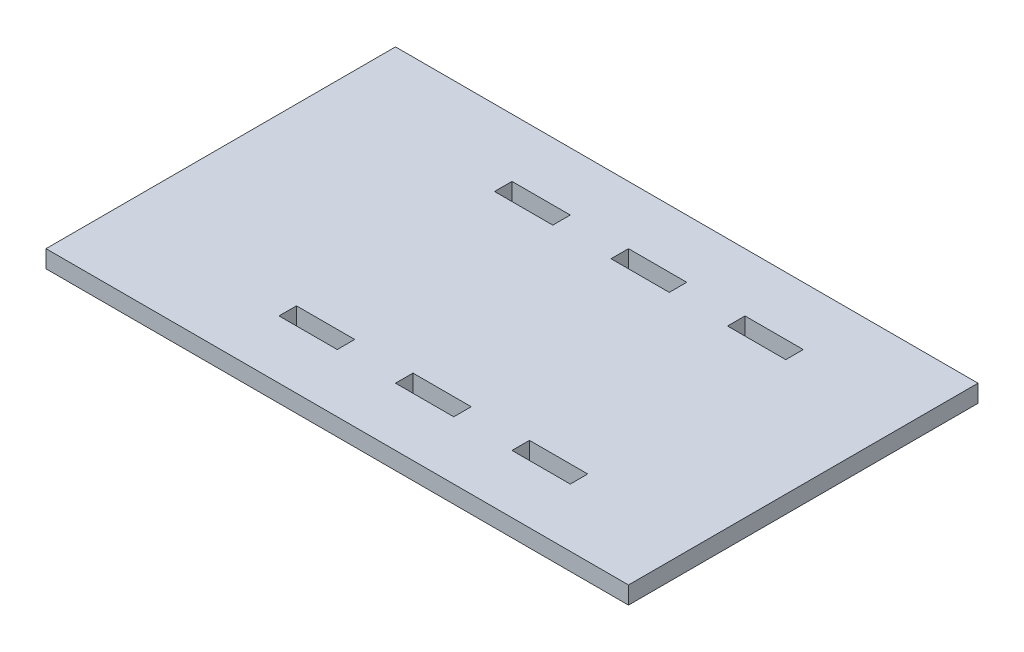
ISO-10303-21;
HEADER;
FILE_DESCRIPTION(('STEP AP214'),'2;1');
FILE_NAME('part.step','',(''),(''),'','','');
FILE_SCHEMA(('AUTOMOTIVE_DESIGN { 1 0 10303 214 1 1 1 1 }'));
ENDSEC;
DATA;
#1=APPLICATION_CONTEXT('core data for automotive mechanical design processes');
#2=APPLICATION_PROTOCOL_DEFINITION('international standard','automotive_design',2000,#1);
#3=PRODUCT_CONTEXT('',#1,'mechanical');
#4=PRODUCT('Part','Part','',(#3));
#5=PRODUCT_RELATED_PRODUCT_CATEGORY('part','',(#4));
#6=PRODUCT_DEFINITION_FORMATION('','',#4);
#7=PRODUCT_DEFINITION_CONTEXT('part definition',#1,'design');
#8=PRODUCT_DEFINITION('design','',#6,#7);
#9=PRODUCT_DEFINITION_SHAPE('','',#8);
#10=(LENGTH_UNIT() NAMED_UNIT(*) SI_UNIT(.MILLI.,.METRE.));
#11=(NAMED_UNIT(*) PLANE_ANGLE_UNIT() SI_UNIT($,.RADIAN.));
#12=(NAMED_UNIT(*) SI_UNIT($,.STERADIAN.) SOLID_ANGLE_UNIT());
#13=UNCERTAINTY_MEASURE_WITH_UNIT(LENGTH_MEASURE(1.E-05),#10,'distance_accuracy_value','');
#14=(GEOMETRIC_REPRESENTATION_CONTEXT(3) GLOBAL_UNCERTAINTY_ASSIGNED_CONTEXT((#13)) GLOBAL_UNIT_ASSIGNED_CONTEXT((#10,
#11,#12)) REPRESENTATION_CONTEXT('',''));
#15=CARTESIAN_POINT('',(0.,0.,0.));
#16=DIRECTION('',(0.,0.,1.));
#17=DIRECTION('',(1.,0.,0.));
#18=AXIS2_PLACEMENT_3D('',#15,#16,#17);
#19=CARTESIAN_POINT('',(250.,15.,150.));
#20=DIRECTION('',(-1.,0.,0.));
#21=DIRECTION('',(0.,0.,1.));
#22=AXIS2_PLACEMENT_3D('',#19,#20,#21);
#23=PLANE('',#22);
#24=DIRECTION('',(0.,0.,-1.));
#25=VECTOR('',#24,1.);
#26=CARTESIAN_POINT('',(250.,0.,150.));
#27=LINE('',#26,#25);
#28=CARTESIAN_POINT('',(250.,0.,150.));
#29=VERTEX_POINT('',#28);
#30=CARTESIAN_POINT('',(250.,0.,-150.));
#31=VERTEX_POINT('',#30);
#32=EDGE_CURVE('E484',#29,#31,#27,.T.);
#33=ORIENTED_EDGE('',*,*,#32,.T.);
#34=DIRECTION('',(0.,-1.,0.));
#35=VECTOR('',#34,1.);
#36=CARTESIAN_POINT('',(250.,15.,-150.));
#37=LINE('',#36,#35);
#38=CARTESIAN_POINT('',(250.,15.,-150.));
#39=VERTEX_POINT('',#38);
#40=EDGE_CURVE('E11',#39,#31,#37,.T.);
#41=ORIENTED_EDGE('',*,*,#40,.F.);
#42=DIRECTION('',(0.,0.,-1.));
#43=VECTOR('',#42,1.);
#44=CARTESIAN_POINT('',(250.,15.,150.));
#45=LINE('',#44,#43);
#46=CARTESIAN_POINT('',(250.,15.,150.));
#47=VERTEX_POINT('',#46);
#48=EDGE_CURVE('E494',#47,#39,#45,.T.);
#49=ORIENTED_EDGE('',*,*,#48,.F.);
#50=DIRECTION('',(0.,-1.,0.));
#51=VECTOR('',#50,1.);
#52=CARTESIAN_POINT('',(250.,15.,150.));
#53=LINE('',#52,#51);
#54=EDGE_CURVE('E508',#47,#29,#53,.T.);
#55=ORIENTED_EDGE('',*,*,#54,.T.);
#56=EDGE_LOOP('',(#33,#41,#49,#55));
#57=FACE_BOUND('',#56,.T.);
#58=ADVANCED_FACE('F45',(#57),#23,.F.);
#59=CARTESIAN_POINT('',(-250.,15.,-150.));
#60=DIRECTION('',(0.,0.,1.));
#61=DIRECTION('',(1.,0.,0.));
#62=AXIS2_PLACEMENT_3D('',#59,#60,#61);
#63=PLANE('',#62);
#64=DIRECTION('',(-1.,0.,0.));
#65=VECTOR('',#64,1.);
#66=CARTESIAN_POINT('',(-250.,0.,-150.));
#67=LINE('',#66,#65);
#68=CARTESIAN_POINT('',(-250.,0.,-150.));
#69=VERTEX_POINT('',#68);
#70=EDGE_CURVE('E512',#31,#69,#67,.T.);
#71=ORIENTED_EDGE('',*,*,#70,.T.);
#72=DIRECTION('',(0.,-1.,0.));
#73=VECTOR('',#72,1.);
#74=CARTESIAN_POINT('',(-250.,15.,-150.));
#75=LINE('',#74,#73);
#76=CARTESIAN_POINT('',(-250.,15.,-150.));
#77=VERTEX_POINT('',#76);
#78=EDGE_CURVE('E53',#77,#69,#75,.T.);
#79=ORIENTED_EDGE('',*,*,#78,.F.);
#80=DIRECTION('',(-1.,0.,0.));
#81=VECTOR('',#80,1.);
#82=CARTESIAN_POINT('',(-250.,15.,-150.));
#83=LINE('',#82,#81);
#84=EDGE_CURVE('E498',#39,#77,#83,.T.);
#85=ORIENTED_EDGE('',*,*,#84,.F.);
#86=ORIENTED_EDGE('',*,*,#40,.T.);
#87=EDGE_LOOP('',(#71,#79,#85,#86));
#88=FACE_BOUND('',#87,.T.);
#89=ADVANCED_FACE('F547',(#88),#63,.F.);
#90=CARTESIAN_POINT('',(-250.,15.,150.));
#91=DIRECTION('',(1.,0.,0.));
#92=DIRECTION('',(0.,0.,-1.));
#93=AXIS2_PLACEMENT_3D('',#90,#91,#92);
#94=PLANE('',#93);
#95=DIRECTION('',(0.,0.,1.));
#96=VECTOR('',#95,1.);
#97=CARTESIAN_POINT('',(-250.,0.,150.));
#98=LINE('',#97,#96);
#99=CARTESIAN_POINT('',(-250.,0.,150.));
#100=VERTEX_POINT('',#99);
#101=EDGE_CURVE('E515',#69,#100,#98,.T.);
#102=ORIENTED_EDGE('',*,*,#101,.T.);
#103=DIRECTION('',(0.,-1.,0.));
#104=VECTOR('',#103,1.);
#105=CARTESIAN_POINT('',(-250.,15.,150.));
#106=LINE('',#105,#104);
#107=CARTESIAN_POINT('',(-250.,15.,150.));
#108=VERTEX_POINT('',#107);
#109=EDGE_CURVE('E523',#108,#100,#106,.T.);
#110=ORIENTED_EDGE('',*,*,#109,.F.);
#111=DIRECTION('',(0.,0.,1.));
#112=VECTOR('',#111,1.);
#113=CARTESIAN_POINT('',(-250.,15.,150.));
#114=LINE('',#113,#112);
#115=EDGE_CURVE('E502',#77,#108,#114,.T.);
#116=ORIENTED_EDGE('',*,*,#115,.F.);
#117=ORIENTED_EDGE('',*,*,#78,.T.);
#118=EDGE_LOOP('',(#102,#110,#116,#117));
#119=FACE_BOUND('',#118,.T.);
#120=ADVANCED_FACE('F532',(#119),#94,.F.);
#121=CARTESIAN_POINT('',(-250.,15.,150.));
#122=DIRECTION('',(0.,0.,-1.));
#123=DIRECTION('',(-1.,0.,0.));
#124=AXIS2_PLACEMENT_3D('',#121,#122,#123);
#125=PLANE('',#124);
#126=DIRECTION('',(1.,0.,0.));
#127=VECTOR('',#126,1.);
#128=CARTESIAN_POINT('',(-250.,0.,150.));
#129=LINE('',#128,#127);
#130=EDGE_CURVE('E499',#100,#29,#129,.T.);
#131=ORIENTED_EDGE('',*,*,#130,.T.);
#132=ORIENTED_EDGE('',*,*,#54,.F.);
#133=DIRECTION('',(1.,0.,0.));
#134=VECTOR('',#133,1.);
#135=CARTESIAN_POINT('',(-250.,15.,150.));
#136=LINE('',#135,#134);
#137=EDGE_CURVE('E505',#108,#47,#136,.T.);
#138=ORIENTED_EDGE('',*,*,#137,.F.);
#139=ORIENTED_EDGE('',*,*,#109,.T.);
#140=EDGE_LOOP('',(#131,#132,#138,#139));
#141=FACE_BOUND('',#140,.T.);
#142=ADVANCED_FACE('F541',(#141),#125,.F.);
#143=CARTESIAN_POINT('',(0.,15.,0.));
#144=DIRECTION('',(0.,-1.,0.));
#145=DIRECTION('',(0.,0.,-1.));
#146=AXIS2_PLACEMENT_3D('',#143,#144,#145);
#147=PLANE('',#146);
#148=DIRECTION('',(1.,0.,0.));
#149=VECTOR('',#148,1.);
#150=CARTESIAN_POINT('',(0.,15.,-85.));
#151=LINE('',#150,#149);
#152=CARTESIAN_POINT('',(0.,15.,-85.));
#153=VERTEX_POINT('',#152);
#154=CARTESIAN_POINT('',(50.,15.,-85.));
#155=VERTEX_POINT('',#154);
#156=EDGE_CURVE('E342',#153,#155,#151,.T.);
#157=ORIENTED_EDGE('',*,*,#156,.F.);
#158=DIRECTION('',(0.,0.,1.));
#159=VECTOR('',#158,1.);
#160=CARTESIAN_POINT('',(0.,15.,-85.));
#161=LINE('',#160,#159);
#162=CARTESIAN_POINT('',(0.,15.,-100.));
#163=VERTEX_POINT('',#162);
#164=EDGE_CURVE('E60',#163,#153,#161,.T.);
#165=ORIENTED_EDGE('',*,*,#164,.F.);
#166=DIRECTION('',(-1.,0.,0.));
#167=VECTOR('',#166,1.);
#168=CARTESIAN_POINT('',(0.,15.,-100.));
#169=LINE('',#168,#167);
#170=CARTESIAN_POINT('',(50.,15.,-100.));
#171=VERTEX_POINT('',#170);
#172=EDGE_CURVE('E333',#171,#163,#169,.T.);
#173=ORIENTED_EDGE('',*,*,#172,.F.);
#174=DIRECTION('',(0.,0.,-1.));
#175=VECTOR('',#174,1.);
#176=CARTESIAN_POINT('',(50.,15.,-85.));
#177=LINE('',#176,#175);
#178=EDGE_CURVE('E337',#155,#171,#177,.T.);
#179=ORIENTED_EDGE('',*,*,#178,.F.);
#180=EDGE_LOOP('',(#157,#165,#173,#179));
#181=FACE_BOUND('',#180,.T.);
#182=DIRECTION('',(0.,0.,1.));
#183=VECTOR('',#182,1.);
#184=CARTESIAN_POINT('',(0.,15.,85.));
#185=LINE('',#184,#183);
#186=CARTESIAN_POINT('',(0.,15.,85.));
#187=VERTEX_POINT('',#186);
#188=CARTESIAN_POINT('',(0.,15.,100.));
#189=VERTEX_POINT('',#188);
#190=EDGE_CURVE('E303',#187,#189,#185,.T.);
#191=ORIENTED_EDGE('',*,*,#190,.F.);
#192=DIRECTION('',(-1.,0.,0.));
#193=VECTOR('',#192,1.);
#194=CARTESIAN_POINT('',(0.,15.,85.));
#195=LINE('',#194,#193);
#196=CARTESIAN_POINT('',(50.,15.,85.));
#197=VERTEX_POINT('',#196);
#198=EDGE_CURVE('E68',#197,#187,#195,.T.);
#199=ORIENTED_EDGE('',*,*,#198,.F.);
#200=DIRECTION('',(0.,0.,-1.));
#201=VECTOR('',#200,1.);
#202=CARTESIAN_POINT('',(50.,15.,85.));
#203=LINE('',#202,#201);
#204=CARTESIAN_POINT('',(50.,15.,100.));
#205=VERTEX_POINT('',#204);
#206=EDGE_CURVE('E294',#205,#197,#203,.T.);
#207=ORIENTED_EDGE('',*,*,#206,.F.);
#208=DIRECTION('',(1.,0.,0.));
#209=VECTOR('',#208,1.);
#210=CARTESIAN_POINT('',(0.,15.,100.));
#211=LINE('',#210,#209);
#212=EDGE_CURVE('E298',#189,#205,#211,.T.);
#213=ORIENTED_EDGE('',*,*,#212,.F.);
#214=EDGE_LOOP('',(#191,#199,#207,#213));
#215=FACE_BOUND('',#214,.T.);
#216=DIRECTION('',(1.,0.,0.));
#217=VECTOR('',#216,1.);
#218=CARTESIAN_POINT('',(-100.,15.,100.));
#219=LINE('',#218,#217);
#220=CARTESIAN_POINT('',(-100.,15.,100.));
#221=VERTEX_POINT('',#220);
#222=CARTESIAN_POINT('',(-50.,15.,100.));
#223=VERTEX_POINT('',#222);
#224=EDGE_CURVE('E430',#221,#223,#219,.T.);
#225=ORIENTED_EDGE('',*,*,#224,.F.);
#226=DIRECTION('',(0.,0.,1.));
#227=VECTOR('',#226,1.);
#228=CARTESIAN_POINT('',(-100.,15.,85.));
#229=LINE('',#228,#227);
#230=CARTESIAN_POINT('',(-100.,15.,85.));
#231=VERTEX_POINT('',#230);
#232=EDGE_CURVE('E376',#231,#221,#229,.T.);
#233=ORIENTED_EDGE('',*,*,#232,.F.);
#234=DIRECTION('',(-1.,0.,0.));
#235=VECTOR('',#234,1.);
#236=CARTESIAN_POINT('',(-100.,15.,85.));
#237=LINE('',#236,#235);
#238=CARTESIAN_POINT('',(-50.,15.,85.));
#239=VERTEX_POINT('',#238);
#240=EDGE_CURVE('E421',#239,#231,#237,.T.);
#241=ORIENTED_EDGE('',*,*,#240,.F.);
#242=DIRECTION('',(0.,0.,-1.));
#243=VECTOR('',#242,1.);
#244=CARTESIAN_POINT('',(-50.,15.,85.));
#245=LINE('',#244,#243);
#246=EDGE_CURVE('E425',#223,#239,#245,.T.);
#247=ORIENTED_EDGE('',*,*,#246,.F.);
#248=EDGE_LOOP('',(#225,#233,#241,#247));
#249=FACE_BOUND('',#248,.T.);
#250=DIRECTION('',(1.,0.,0.));
#251=VECTOR('',#250,1.);
#252=CARTESIAN_POINT('',(100.,15.,-85.));
#253=LINE('',#252,#251);
#254=CARTESIAN_POINT('',(100.,15.,-85.));
#255=VERTEX_POINT('',#254);
#256=CARTESIAN_POINT('',(150.,15.,-85.));
#257=VERTEX_POINT('',#256);
#258=EDGE_CURVE('E386',#255,#257,#253,.T.);
#259=ORIENTED_EDGE('',*,*,#258,.F.);
#260=DIRECTION('',(0.,0.,1.));
#261=VECTOR('',#260,1.);
#262=CARTESIAN_POINT('',(100.,15.,-85.));
#263=LINE('',#262,#261);
#264=CARTESIAN_POINT('',(100.,15.,-100.));
#265=VERTEX_POINT('',#264);
#266=EDGE_CURVE('E390',#265,#255,#263,.T.);
#267=ORIENTED_EDGE('',*,*,#266,.F.);
#268=DIRECTION('',(-1.,0.,0.));
#269=VECTOR('',#268,1.);
#270=CARTESIAN_POINT('',(100.,15.,-100.));
#271=LINE('',#270,#269);
#272=CARTESIAN_POINT('',(150.,15.,-100.));
#273=VERTEX_POINT('',#272);
#274=EDGE_CURVE('E377',#273,#265,#271,.T.);
#275=ORIENTED_EDGE('',*,*,#274,.F.);
#276=DIRECTION('',(0.,0.,-1.));
#277=VECTOR('',#276,1.);
#278=CARTESIAN_POINT('',(150.,15.,-85.));
#279=LINE('',#278,#277);
#280=EDGE_CURVE('E381',#257,#273,#279,.T.);
#281=ORIENTED_EDGE('',*,*,#280,.F.);
#282=EDGE_LOOP('',(#259,#267,#275,#281));
#283=FACE_BOUND('',#282,.T.);
#284=DIRECTION('',(0.,0.,-1.));
#285=VECTOR('',#284,1.);
#286=CARTESIAN_POINT('',(-50.,15.,-85.));
#287=LINE('',#286,#285);
#288=CARTESIAN_POINT('',(-50.,15.,-85.));
#289=VERTEX_POINT('',#288);
#290=CARTESIAN_POINT('',(-50.,15.,-100.));
#291=VERTEX_POINT('',#290);
#292=EDGE_CURVE('E256',#289,#291,#287,.T.);
#293=ORIENTED_EDGE('',*,*,#292,.F.);
#294=DIRECTION('',(1.,0.,0.));
#295=VECTOR('',#294,1.);
#296=CARTESIAN_POINT('',(-100.,15.,-85.));
#297=LINE('',#296,#295);
#298=CARTESIAN_POINT('',(-100.,15.,-85.));
#299=VERTEX_POINT('',#298);
#300=EDGE_CURVE('E233',#299,#289,#297,.T.);
#301=ORIENTED_EDGE('',*,*,#300,.F.);
#302=DIRECTION('',(0.,0.,1.));
#303=VECTOR('',#302,1.);
#304=CARTESIAN_POINT('',(-100.,15.,-85.));
#305=LINE('',#304,#303);
#306=CARTESIAN_POINT('',(-100.,15.,-100.));
#307=VERTEX_POINT('',#306);
#308=EDGE_CURVE('E244',#307,#299,#305,.T.);
#309=ORIENTED_EDGE('',*,*,#308,.F.);
#310=DIRECTION('',(-1.,0.,0.));
#311=VECTOR('',#310,1.);
#312=CARTESIAN_POINT('',(-100.,15.,-100.));
#313=LINE('',#312,#311);
#314=EDGE_CURVE('E250',#291,#307,#313,.T.);
#315=ORIENTED_EDGE('',*,*,#314,.F.);
#316=EDGE_LOOP('',(#293,#301,#309,#315));
#317=FACE_BOUND('',#316,.T.);
#318=DIRECTION('',(0.,0.,1.));
#319=VECTOR('',#318,1.);
#320=CARTESIAN_POINT('',(100.,15.,85.));
#321=LINE('',#320,#319);
#322=CARTESIAN_POINT('',(100.,15.,85.));
#323=VERTEX_POINT('',#322);
#324=CARTESIAN_POINT('',(100.,15.,100.));
#325=VERTEX_POINT('',#324);
#326=EDGE_CURVE('E470',#323,#325,#321,.T.);
#327=ORIENTED_EDGE('',*,*,#326,.F.);
#328=DIRECTION('',(-1.,0.,0.));
#329=VECTOR('',#328,1.);
#330=CARTESIAN_POINT('',(100.,15.,85.));
#331=LINE('',#330,#329);
#332=CARTESIAN_POINT('',(150.,15.,85.));
#333=VERTEX_POINT('',#332);
#334=EDGE_CURVE('E393',#333,#323,#331,.T.);
#335=ORIENTED_EDGE('',*,*,#334,.F.);
#336=DIRECTION('',(0.,0.,-1.));
#337=VECTOR('',#336,1.);
#338=CARTESIAN_POINT('',(150.,15.,85.));
#339=LINE('',#338,#337);
#340=CARTESIAN_POINT('',(150.,15.,100.));
#341=VERTEX_POINT('',#340);
#342=EDGE_CURVE('E455',#341,#333,#339,.T.);
#343=ORIENTED_EDGE('',*,*,#342,.F.);
#344=DIRECTION('',(1.,0.,0.));
#345=VECTOR('',#344,1.);
#346=CARTESIAN_POINT('',(100.,15.,100.));
#347=LINE('',#346,#345);
#348=EDGE_CURVE('E474',#325,#341,#347,.T.);
#349=ORIENTED_EDGE('',*,*,#348,.F.);
#350=EDGE_LOOP('',(#327,#335,#343,#349));
#351=FACE_BOUND('',#350,.T.);
#352=ORIENTED_EDGE('',*,*,#48,.T.);
#353=ORIENTED_EDGE('',*,*,#84,.T.);
#354=ORIENTED_EDGE('',*,*,#115,.T.);
#355=ORIENTED_EDGE('',*,*,#137,.T.);
#356=EDGE_LOOP('',(#352,#353,#354,#355));
#357=FACE_BOUND('',#356,.T.);
#358=ADVANCED_FACE('F253',(#181,#215,#249,#283,#317,#351,#357),#147,.F.);
#359=CARTESIAN_POINT('',(0.,0.,0.));
#360=DIRECTION('',(0.,-1.,0.));
#361=DIRECTION('',(0.,0.,-1.));
#362=AXIS2_PLACEMENT_3D('',#359,#360,#361);
#363=PLANE('',#362);
#364=DIRECTION('',(0.,0.,1.));
#365=VECTOR('',#364,1.);
#366=CARTESIAN_POINT('',(0.,0.,-85.));
#367=LINE('',#366,#365);
#368=CARTESIAN_POINT('',(0.,0.,-100.));
#369=VERTEX_POINT('',#368);
#370=CARTESIAN_POINT('',(0.,0.,-85.));
#371=VERTEX_POINT('',#370);
#372=EDGE_CURVE('E338',#369,#371,#367,.T.);
#373=ORIENTED_EDGE('',*,*,#372,.T.);
#374=DIRECTION('',(1.,0.,0.));
#375=VECTOR('',#374,1.);
#376=CARTESIAN_POINT('',(0.,0.,-85.));
#377=LINE('',#376,#375);
#378=CARTESIAN_POINT('',(50.,0.,-85.));
#379=VERTEX_POINT('',#378);
#380=EDGE_CURVE('E355',#371,#379,#377,.T.);
#381=ORIENTED_EDGE('',*,*,#380,.T.);
#382=DIRECTION('',(0.,0.,-1.));
#383=VECTOR('',#382,1.);
#384=CARTESIAN_POINT('',(50.,0.,-85.));
#385=LINE('',#384,#383);
#386=CARTESIAN_POINT('',(50.,0.,-100.));
#387=VERTEX_POINT('',#386);
#388=EDGE_CURVE('E351',#379,#387,#385,.T.);
#389=ORIENTED_EDGE('',*,*,#388,.T.);
#390=DIRECTION('',(-1.,0.,0.));
#391=VECTOR('',#390,1.);
#392=CARTESIAN_POINT('',(0.,0.,-100.));
#393=LINE('',#392,#391);
#394=EDGE_CURVE('E327',#387,#369,#393,.T.);
#395=ORIENTED_EDGE('',*,*,#394,.T.);
#396=EDGE_LOOP('',(#373,#381,#389,#395));
#397=FACE_BOUND('',#396,.T.);
#398=DIRECTION('',(-1.,0.,0.));
#399=VECTOR('',#398,1.);
#400=CARTESIAN_POINT('',(0.,0.,85.));
#401=LINE('',#400,#399);
#402=CARTESIAN_POINT('',(50.,0.,85.));
#403=VERTEX_POINT('',#402);
#404=CARTESIAN_POINT('',(0.,0.,85.));
#405=VERTEX_POINT('',#404);
#406=EDGE_CURVE('E299',#403,#405,#401,.T.);
#407=ORIENTED_EDGE('',*,*,#406,.T.);
#408=DIRECTION('',(0.,0.,1.));
#409=VECTOR('',#408,1.);
#410=CARTESIAN_POINT('',(0.,0.,85.));
#411=LINE('',#410,#409);
#412=CARTESIAN_POINT('',(0.,0.,100.));
#413=VERTEX_POINT('',#412);
#414=EDGE_CURVE('E317',#405,#413,#411,.T.);
#415=ORIENTED_EDGE('',*,*,#414,.T.);
#416=DIRECTION('',(1.,0.,0.));
#417=VECTOR('',#416,1.);
#418=CARTESIAN_POINT('',(0.,0.,100.));
#419=LINE('',#418,#417);
#420=CARTESIAN_POINT('',(50.,0.,100.));
#421=VERTEX_POINT('',#420);
#422=EDGE_CURVE('E313',#413,#421,#419,.T.);
#423=ORIENTED_EDGE('',*,*,#422,.T.);
#424=DIRECTION('',(0.,0.,-1.));
#425=VECTOR('',#424,1.);
#426=CARTESIAN_POINT('',(50.,0.,85.));
#427=LINE('',#426,#425);
#428=EDGE_CURVE('E284',#421,#403,#427,.T.);
#429=ORIENTED_EDGE('',*,*,#428,.T.);
#430=EDGE_LOOP('',(#407,#415,#423,#429));
#431=FACE_BOUND('',#430,.T.);
#432=DIRECTION('',(0.,0.,1.));
#433=VECTOR('',#432,1.);
#434=CARTESIAN_POINT('',(-100.,0.,85.));
#435=LINE('',#434,#433);
#436=CARTESIAN_POINT('',(-100.,0.,85.));
#437=VERTEX_POINT('',#436);
#438=CARTESIAN_POINT('',(-100.,0.,100.));
#439=VERTEX_POINT('',#438);
#440=EDGE_CURVE('E426',#437,#439,#435,.T.);
#441=ORIENTED_EDGE('',*,*,#440,.T.);
#442=DIRECTION('',(1.,0.,0.));
#443=VECTOR('',#442,1.);
#444=CARTESIAN_POINT('',(-100.,0.,100.));
#445=LINE('',#444,#443);
#446=CARTESIAN_POINT('',(-50.,0.,100.));
#447=VERTEX_POINT('',#446);
#448=EDGE_CURVE('E443',#439,#447,#445,.T.);
#449=ORIENTED_EDGE('',*,*,#448,.T.);
#450=DIRECTION('',(0.,0.,-1.));
#451=VECTOR('',#450,1.);
#452=CARTESIAN_POINT('',(-50.,0.,85.));
#453=LINE('',#452,#451);
#454=CARTESIAN_POINT('',(-50.,0.,85.));
#455=VERTEX_POINT('',#454);
#456=EDGE_CURVE('E439',#447,#455,#453,.T.);
#457=ORIENTED_EDGE('',*,*,#456,.T.);
#458=DIRECTION('',(-1.,0.,0.));
#459=VECTOR('',#458,1.);
#460=CARTESIAN_POINT('',(-100.,0.,85.));
#461=LINE('',#460,#459);
#462=EDGE_CURVE('E412',#455,#437,#461,.T.);
#463=ORIENTED_EDGE('',*,*,#462,.T.);
#464=EDGE_LOOP('',(#441,#449,#457,#463));
#465=FACE_BOUND('',#464,.T.);
#466=DIRECTION('',(0.,0.,1.));
#467=VECTOR('',#466,1.);
#468=CARTESIAN_POINT('',(100.,0.,-85.));
#469=LINE('',#468,#467);
#470=CARTESIAN_POINT('',(100.,0.,-100.));
#471=VERTEX_POINT('',#470);
#472=CARTESIAN_POINT('',(100.,0.,-85.));
#473=VERTEX_POINT('',#472);
#474=EDGE_CURVE('E382',#471,#473,#469,.T.);
#475=ORIENTED_EDGE('',*,*,#474,.T.);
#476=DIRECTION('',(1.,0.,0.));
#477=VECTOR('',#476,1.);
#478=CARTESIAN_POINT('',(100.,0.,-85.));
#479=LINE('',#478,#477);
#480=CARTESIAN_POINT('',(150.,0.,-85.));
#481=VERTEX_POINT('',#480);
#482=EDGE_CURVE('E401',#473,#481,#479,.T.);
#483=ORIENTED_EDGE('',*,*,#482,.T.);
#484=DIRECTION('',(0.,0.,-1.));
#485=VECTOR('',#484,1.);
#486=CARTESIAN_POINT('',(150.,0.,-85.));
#487=LINE('',#486,#485);
#488=CARTESIAN_POINT('',(150.,0.,-100.));
#489=VERTEX_POINT('',#488);
#490=EDGE_CURVE('E397',#481,#489,#487,.T.);
#491=ORIENTED_EDGE('',*,*,#490,.T.);
#492=DIRECTION('',(-1.,0.,0.));
#493=VECTOR('',#492,1.);
#494=CARTESIAN_POINT('',(100.,0.,-100.));
#495=LINE('',#494,#493);
#496=EDGE_CURVE('E366',#489,#471,#495,.T.);
#497=ORIENTED_EDGE('',*,*,#496,.T.);
#498=EDGE_LOOP('',(#475,#483,#491,#497));
#499=FACE_BOUND('',#498,.T.);
#500=DIRECTION('',(1.,0.,0.));
#501=VECTOR('',#500,1.);
#502=CARTESIAN_POINT('',(-100.,0.,-85.));
#503=LINE('',#502,#501);
#504=CARTESIAN_POINT('',(-100.,0.,-85.));
#505=VERTEX_POINT('',#504);
#506=CARTESIAN_POINT('',(-50.,0.,-85.));
#507=VERTEX_POINT('',#506);
#508=EDGE_CURVE('E236',#505,#507,#503,.T.);
#509=ORIENTED_EDGE('',*,*,#508,.T.);
#510=DIRECTION('',(0.,0.,-1.));
#511=VECTOR('',#510,1.);
#512=CARTESIAN_POINT('',(-50.,0.,-85.));
#513=LINE('',#512,#511);
#514=CARTESIAN_POINT('',(-50.,0.,-100.));
#515=VERTEX_POINT('',#514);
#516=EDGE_CURVE('E275',#507,#515,#513,.T.);
#517=ORIENTED_EDGE('',*,*,#516,.T.);
#518=DIRECTION('',(-1.,0.,0.));
#519=VECTOR('',#518,1.);
#520=CARTESIAN_POINT('',(-100.,0.,-100.));
#521=LINE('',#520,#519);
#522=CARTESIAN_POINT('',(-100.,0.,-100.));
#523=VERTEX_POINT('',#522);
#524=EDGE_CURVE('E270',#515,#523,#521,.T.);
#525=ORIENTED_EDGE('',*,*,#524,.T.);
#526=DIRECTION('',(0.,0.,1.));
#527=VECTOR('',#526,1.);
#528=CARTESIAN_POINT('',(-100.,0.,-85.));
#529=LINE('',#528,#527);
#530=EDGE_CURVE('E267',#523,#505,#529,.T.);
#531=ORIENTED_EDGE('',*,*,#530,.T.);
#532=EDGE_LOOP('',(#509,#517,#525,#531));
#533=FACE_BOUND('',#532,.T.);
#534=DIRECTION('',(-1.,0.,0.));
#535=VECTOR('',#534,1.);
#536=CARTESIAN_POINT('',(100.,0.,85.));
#537=LINE('',#536,#535);
#538=CARTESIAN_POINT('',(150.,0.,85.));
#539=VERTEX_POINT('',#538);
#540=CARTESIAN_POINT('',(100.,0.,85.));
#541=VERTEX_POINT('',#540);
#542=EDGE_CURVE('E450',#539,#541,#537,.T.);
#543=ORIENTED_EDGE('',*,*,#542,.T.);
#544=DIRECTION('',(0.,0.,1.));
#545=VECTOR('',#544,1.);
#546=CARTESIAN_POINT('',(100.,0.,85.));
#547=LINE('',#546,#545);
#548=CARTESIAN_POINT('',(100.,0.,100.));
#549=VERTEX_POINT('',#548);
#550=EDGE_CURVE('E454',#541,#549,#547,.T.);
#551=ORIENTED_EDGE('',*,*,#550,.T.);
#552=DIRECTION('',(1.,0.,0.));
#553=VECTOR('',#552,1.);
#554=CARTESIAN_POINT('',(100.,0.,100.));
#555=LINE('',#554,#553);
#556=CARTESIAN_POINT('',(150.,0.,100.));
#557=VERTEX_POINT('',#556);
#558=EDGE_CURVE('E459',#549,#557,#555,.T.);
#559=ORIENTED_EDGE('',*,*,#558,.T.);
#560=DIRECTION('',(0.,0.,-1.));
#561=VECTOR('',#560,1.);
#562=CARTESIAN_POINT('',(150.,0.,85.));
#563=LINE('',#562,#561);
#564=EDGE_CURVE('E463',#557,#539,#563,.T.);
#565=ORIENTED_EDGE('',*,*,#564,.T.);
#566=EDGE_LOOP('',(#543,#551,#559,#565));
#567=FACE_BOUND('',#566,.T.);
#568=ORIENTED_EDGE('',*,*,#32,.F.);
#569=ORIENTED_EDGE('',*,*,#130,.F.);
#570=ORIENTED_EDGE('',*,*,#101,.F.);
#571=ORIENTED_EDGE('',*,*,#70,.F.);
#572=EDGE_LOOP('',(#568,#569,#570,#571));
#573=FACE_BOUND('',#572,.T.);
#574=ADVANCED_FACE('F538',(#397,#431,#465,#499,#533,#567,#573),#363,.T.);
#575=CARTESIAN_POINT('',(100.,0.,85.));
#576=DIRECTION('',(0.,0.,-1.));
#577=DIRECTION('',(-1.,0.,0.));
#578=AXIS2_PLACEMENT_3D('',#575,#576,#577);
#579=PLANE('',#578);
#580=ORIENTED_EDGE('',*,*,#334,.T.);
#581=DIRECTION('',(0.,1.,0.));
#582=VECTOR('',#581,1.);
#583=CARTESIAN_POINT('',(100.,0.,85.));
#584=LINE('',#583,#582);
#585=EDGE_CURVE('E467',#541,#323,#584,.T.);
#586=ORIENTED_EDGE('',*,*,#585,.F.);
#587=ORIENTED_EDGE('',*,*,#542,.F.);
#588=DIRECTION('',(0.,1.,0.));
#589=VECTOR('',#588,1.);
#590=CARTESIAN_POINT('',(150.,0.,85.));
#591=LINE('',#590,#589);
#592=EDGE_CURVE('E481',#539,#333,#591,.T.);
#593=ORIENTED_EDGE('',*,*,#592,.T.);
#594=EDGE_LOOP('',(#580,#586,#587,#593));
#595=FACE_BOUND('',#594,.T.);
#596=ADVANCED_FACE('F559',(#595),#579,.F.);
#597=CARTESIAN_POINT('',(150.,0.,85.));
#598=DIRECTION('',(1.,0.,0.));
#599=DIRECTION('',(0.,0.,-1.));
#600=AXIS2_PLACEMENT_3D('',#597,#598,#599);
#601=PLANE('',#600);
#602=ORIENTED_EDGE('',*,*,#342,.T.);
#603=ORIENTED_EDGE('',*,*,#592,.F.);
#604=ORIENTED_EDGE('',*,*,#564,.F.);
#605=DIRECTION('',(0.,1.,0.));
#606=VECTOR('',#605,1.);
#607=CARTESIAN_POINT('',(150.,0.,100.));
#608=LINE('',#607,#606);
#609=EDGE_CURVE('E485',#557,#341,#608,.T.);
#610=ORIENTED_EDGE('',*,*,#609,.T.);
#611=EDGE_LOOP('',(#602,#603,#604,#610));
#612=FACE_BOUND('',#611,.T.);
#613=ADVANCED_FACE('F566',(#612),#601,.F.);
#614=CARTESIAN_POINT('',(100.,0.,100.));
#615=DIRECTION('',(0.,0.,1.));
#616=DIRECTION('',(1.,0.,0.));
#617=AXIS2_PLACEMENT_3D('',#614,#615,#616);
#618=PLANE('',#617);
#619=ORIENTED_EDGE('',*,*,#348,.T.);
#620=ORIENTED_EDGE('',*,*,#609,.F.);
#621=ORIENTED_EDGE('',*,*,#558,.F.);
#622=DIRECTION('',(0.,1.,0.));
#623=VECTOR('',#622,1.);
#624=CARTESIAN_POINT('',(100.,0.,100.));
#625=LINE('',#624,#623);
#626=EDGE_CURVE('E488',#549,#325,#625,.T.);
#627=ORIENTED_EDGE('',*,*,#626,.T.);
#628=EDGE_LOOP('',(#619,#620,#621,#627));
#629=FACE_BOUND('',#628,.T.);
#630=ADVANCED_FACE('F571',(#629),#618,.F.);
#631=CARTESIAN_POINT('',(100.,0.,85.));
#632=DIRECTION('',(-1.,0.,0.));
#633=DIRECTION('',(0.,0.,1.));
#634=AXIS2_PLACEMENT_3D('',#631,#632,#633);
#635=PLANE('',#634);
#636=ORIENTED_EDGE('',*,*,#326,.T.);
#637=ORIENTED_EDGE('',*,*,#626,.F.);
#638=ORIENTED_EDGE('',*,*,#550,.F.);
#639=ORIENTED_EDGE('',*,*,#585,.T.);
#640=EDGE_LOOP('',(#636,#637,#638,#639));
#641=FACE_BOUND('',#640,.T.);
#642=ADVANCED_FACE('F568',(#641),#635,.F.);
#643=CARTESIAN_POINT('',(-100.,0.,-85.));
#644=DIRECTION('',(0.,0.,1.));
#645=DIRECTION('',(1.,0.,0.));
#646=AXIS2_PLACEMENT_3D('',#643,#644,#645);
#647=PLANE('',#646);
#648=ORIENTED_EDGE('',*,*,#300,.T.);
#649=DIRECTION('',(0.,1.,0.));
#650=VECTOR('',#649,1.);
#651=CARTESIAN_POINT('',(-50.,0.,-85.));
#652=LINE('',#651,#650);
#653=EDGE_CURVE('E271',#507,#289,#652,.T.);
#654=ORIENTED_EDGE('',*,*,#653,.F.);
#655=ORIENTED_EDGE('',*,*,#508,.F.);
#656=DIRECTION('',(0.,1.,0.));
#657=VECTOR('',#656,1.);
#658=CARTESIAN_POINT('',(-100.,0.,-85.));
#659=LINE('',#658,#657);
#660=EDGE_CURVE('E229',#505,#299,#659,.T.);
#661=ORIENTED_EDGE('',*,*,#660,.T.);
#662=EDGE_LOOP('',(#648,#654,#655,#661));
#663=FACE_BOUND('',#662,.T.);
#664=ADVANCED_FACE('F231',(#663),#647,.F.);
#665=CARTESIAN_POINT('',(-100.,0.,-85.));
#666=DIRECTION('',(-1.,0.,0.));
#667=DIRECTION('',(0.,0.,1.));
#668=AXIS2_PLACEMENT_3D('',#665,#666,#667);
#669=PLANE('',#668);
#670=ORIENTED_EDGE('',*,*,#308,.T.);
#671=ORIENTED_EDGE('',*,*,#660,.F.);
#672=ORIENTED_EDGE('',*,*,#530,.F.);
#673=DIRECTION('',(0.,1.,0.));
#674=VECTOR('',#673,1.);
#675=CARTESIAN_POINT('',(-100.,0.,-100.));
#676=LINE('',#675,#674);
#677=EDGE_CURVE('E241',#523,#307,#676,.T.);
#678=ORIENTED_EDGE('',*,*,#677,.T.);
#679=EDGE_LOOP('',(#670,#671,#672,#678));
#680=FACE_BOUND('',#679,.T.);
#681=ADVANCED_FACE('F245',(#680),#669,.F.);
#682=CARTESIAN_POINT('',(-100.,0.,-100.));
#683=DIRECTION('',(0.,0.,-1.));
#684=DIRECTION('',(-1.,0.,0.));
#685=AXIS2_PLACEMENT_3D('',#682,#683,#684);
#686=PLANE('',#685);
#687=ORIENTED_EDGE('',*,*,#314,.T.);
#688=ORIENTED_EDGE('',*,*,#677,.F.);
#689=ORIENTED_EDGE('',*,*,#524,.F.);
#690=DIRECTION('',(0.,1.,0.));
#691=VECTOR('',#690,1.);
#692=CARTESIAN_POINT('',(-50.,0.,-100.));
#693=LINE('',#692,#691);
#694=EDGE_CURVE('E892',#515,#291,#693,.T.);
#695=ORIENTED_EDGE('',*,*,#694,.T.);
#696=EDGE_LOOP('',(#687,#688,#689,#695));
#697=FACE_BOUND('',#696,.T.);
#698=ADVANCED_FACE('F644',(#697),#686,.F.);
#699=CARTESIAN_POINT('',(-50.,0.,-85.));
#700=DIRECTION('',(1.,0.,0.));
#701=DIRECTION('',(0.,0.,-1.));
#702=AXIS2_PLACEMENT_3D('',#699,#700,#701);
#703=PLANE('',#702);
#704=ORIENTED_EDGE('',*,*,#292,.T.);
#705=ORIENTED_EDGE('',*,*,#694,.F.);
#706=ORIENTED_EDGE('',*,*,#516,.F.);
#707=ORIENTED_EDGE('',*,*,#653,.T.);
#708=EDGE_LOOP('',(#704,#705,#706,#707));
#709=FACE_BOUND('',#708,.T.);
#710=ADVANCED_FACE('F611',(#709),#703,.F.);
#711=CARTESIAN_POINT('',(100.,0.,-85.));
#712=DIRECTION('',(-1.,0.,0.));
#713=DIRECTION('',(0.,0.,1.));
#714=AXIS2_PLACEMENT_3D('',#711,#712,#713);
#715=PLANE('',#714);
#716=ORIENTED_EDGE('',*,*,#266,.T.);
#717=DIRECTION('',(0.,1.,0.));
#718=VECTOR('',#717,1.);
#719=CARTESIAN_POINT('',(100.,0.,-85.));
#720=LINE('',#719,#718);
#721=EDGE_CURVE('E362',#473,#255,#720,.T.);
#722=ORIENTED_EDGE('',*,*,#721,.F.);
#723=ORIENTED_EDGE('',*,*,#474,.F.);
#724=DIRECTION('',(0.,1.,0.));
#725=VECTOR('',#724,1.);
#726=CARTESIAN_POINT('',(100.,0.,-100.));
#727=LINE('',#726,#725);
#728=EDGE_CURVE('E373',#471,#265,#727,.T.);
#729=ORIENTED_EDGE('',*,*,#728,.T.);
#730=EDGE_LOOP('',(#716,#722,#723,#729));
#731=FACE_BOUND('',#730,.T.);
#732=ADVANCED_FACE('F601',(#731),#715,.F.);
#733=CARTESIAN_POINT('',(100.,0.,-100.));
#734=DIRECTION('',(0.,0.,-1.));
#735=DIRECTION('',(-1.,0.,0.));
#736=AXIS2_PLACEMENT_3D('',#733,#734,#735);
#737=PLANE('',#736);
#738=ORIENTED_EDGE('',*,*,#274,.T.);
#739=ORIENTED_EDGE('',*,*,#728,.F.);
#740=ORIENTED_EDGE('',*,*,#496,.F.);
#741=DIRECTION('',(0.,1.,0.));
#742=VECTOR('',#741,1.);
#743=CARTESIAN_POINT('',(150.,0.,-100.));
#744=LINE('',#743,#742);
#745=EDGE_CURVE('E370',#489,#273,#744,.T.);
#746=ORIENTED_EDGE('',*,*,#745,.T.);
#747=EDGE_LOOP('',(#738,#739,#740,#746));
#748=FACE_BOUND('',#747,.T.);
#749=ADVANCED_FACE('F597',(#748),#737,.F.);
#750=CARTESIAN_POINT('',(150.,0.,-85.));
#751=DIRECTION('',(1.,0.,0.));
#752=DIRECTION('',(0.,0.,-1.));
#753=AXIS2_PLACEMENT_3D('',#750,#751,#752);
#754=PLANE('',#753);
#755=ORIENTED_EDGE('',*,*,#280,.T.);
#756=ORIENTED_EDGE('',*,*,#745,.F.);
#757=ORIENTED_EDGE('',*,*,#490,.F.);
#758=DIRECTION('',(0.,1.,0.));
#759=VECTOR('',#758,1.);
#760=CARTESIAN_POINT('',(150.,0.,-85.));
#761=LINE('',#760,#759);
#762=EDGE_CURVE('E367',#481,#257,#761,.T.);
#763=ORIENTED_EDGE('',*,*,#762,.T.);
#764=EDGE_LOOP('',(#755,#756,#757,#763));
#765=FACE_BOUND('',#764,.T.);
#766=ADVANCED_FACE('F600',(#765),#754,.F.);
#767=CARTESIAN_POINT('',(100.,0.,-85.));
#768=DIRECTION('',(0.,0.,1.));
#769=DIRECTION('',(1.,0.,0.));
#770=AXIS2_PLACEMENT_3D('',#767,#768,#769);
#771=PLANE('',#770);
#772=ORIENTED_EDGE('',*,*,#258,.T.);
#773=ORIENTED_EDGE('',*,*,#762,.F.);
#774=ORIENTED_EDGE('',*,*,#482,.F.);
#775=ORIENTED_EDGE('',*,*,#721,.T.);
#776=EDGE_LOOP('',(#772,#773,#774,#775));
#777=FACE_BOUND('',#776,.T.);
#778=ADVANCED_FACE('F595',(#777),#771,.F.);
#779=CARTESIAN_POINT('',(-100.,0.,85.));
#780=DIRECTION('',(-1.,0.,0.));
#781=DIRECTION('',(0.,0.,1.));
#782=AXIS2_PLACEMENT_3D('',#779,#780,#781);
#783=PLANE('',#782);
#784=ORIENTED_EDGE('',*,*,#232,.T.);
#785=DIRECTION('',(0.,1.,0.));
#786=VECTOR('',#785,1.);
#787=CARTESIAN_POINT('',(-100.,0.,100.));
#788=LINE('',#787,#786);
#789=EDGE_CURVE('E408',#439,#221,#788,.T.);
#790=ORIENTED_EDGE('',*,*,#789,.F.);
#791=ORIENTED_EDGE('',*,*,#440,.F.);
#792=DIRECTION('',(0.,1.,0.));
#793=VECTOR('',#792,1.);
#794=CARTESIAN_POINT('',(-100.,0.,85.));
#795=LINE('',#794,#793);
#796=EDGE_CURVE('E309',#437,#231,#795,.T.);
#797=ORIENTED_EDGE('',*,*,#796,.T.);
#798=EDGE_LOOP('',(#784,#790,#791,#797));
#799=FACE_BOUND('',#798,.T.);
#800=ADVANCED_FACE('F583',(#799),#783,.F.);
#801=CARTESIAN_POINT('',(-100.,0.,85.));
#802=DIRECTION('',(0.,0.,-1.));
#803=DIRECTION('',(-1.,0.,0.));
#804=AXIS2_PLACEMENT_3D('',#801,#802,#803);
#805=PLANE('',#804);
#806=ORIENTED_EDGE('',*,*,#240,.T.);
#807=ORIENTED_EDGE('',*,*,#796,.F.);
#808=ORIENTED_EDGE('',*,*,#462,.F.);
#809=DIRECTION('',(0.,1.,0.));
#810=VECTOR('',#809,1.);
#811=CARTESIAN_POINT('',(-50.,0.,85.));
#812=LINE('',#811,#810);
#813=EDGE_CURVE('E416',#455,#239,#812,.T.);
#814=ORIENTED_EDGE('',*,*,#813,.T.);
#815=EDGE_LOOP('',(#806,#807,#808,#814));
#816=FACE_BOUND('',#815,.T.);
#817=ADVANCED_FACE('F579',(#816),#805,.F.);
#818=CARTESIAN_POINT('',(-50.,0.,85.));
#819=DIRECTION('',(1.,0.,0.));
#820=DIRECTION('',(0.,0.,-1.));
#821=AXIS2_PLACEMENT_3D('',#818,#819,#820);
#822=PLANE('',#821);
#823=ORIENTED_EDGE('',*,*,#246,.T.);
#824=ORIENTED_EDGE('',*,*,#813,.F.);
#825=ORIENTED_EDGE('',*,*,#456,.F.);
#826=DIRECTION('',(0.,1.,0.));
#827=VECTOR('',#826,1.);
#828=CARTESIAN_POINT('',(-50.,0.,100.));
#829=LINE('',#828,#827);
#830=EDGE_CURVE('E413',#447,#223,#829,.T.);
#831=ORIENTED_EDGE('',*,*,#830,.T.);
#832=EDGE_LOOP('',(#823,#824,#825,#831));
#833=FACE_BOUND('',#832,.T.);
#834=ADVANCED_FACE('F582',(#833),#822,.F.);
#835=CARTESIAN_POINT('',(-100.,0.,100.));
#836=DIRECTION('',(0.,0.,1.));
#837=DIRECTION('',(1.,0.,0.));
#838=AXIS2_PLACEMENT_3D('',#835,#836,#837);
#839=PLANE('',#838);
#840=ORIENTED_EDGE('',*,*,#224,.T.);
#841=ORIENTED_EDGE('',*,*,#830,.F.);
#842=ORIENTED_EDGE('',*,*,#448,.F.);
#843=ORIENTED_EDGE('',*,*,#789,.T.);
#844=EDGE_LOOP('',(#840,#841,#842,#843));
#845=FACE_BOUND('',#844,.T.);
#846=ADVANCED_FACE('F587',(#845),#839,.F.);
#847=CARTESIAN_POINT('',(0.,0.,85.));
#848=DIRECTION('',(0.,0.,-1.));
#849=DIRECTION('',(-1.,0.,0.));
#850=AXIS2_PLACEMENT_3D('',#847,#848,#849);
#851=PLANE('',#850);
#852=ORIENTED_EDGE('',*,*,#198,.T.);
#853=DIRECTION('',(0.,1.,0.));
#854=VECTOR('',#853,1.);
#855=CARTESIAN_POINT('',(0.,0.,85.));
#856=LINE('',#855,#854);
#857=EDGE_CURVE('E281',#405,#187,#856,.T.);
#858=ORIENTED_EDGE('',*,*,#857,.F.);
#859=ORIENTED_EDGE('',*,*,#406,.F.);
#860=DIRECTION('',(0.,1.,0.));
#861=VECTOR('',#860,1.);
#862=CARTESIAN_POINT('',(50.,0.,85.));
#863=LINE('',#862,#861);
#864=EDGE_CURVE('E291',#403,#197,#863,.T.);
#865=ORIENTED_EDGE('',*,*,#864,.T.);
#866=EDGE_LOOP('',(#852,#858,#859,#865));
#867=FACE_BOUND('',#866,.T.);
#868=ADVANCED_FACE('F591',(#867),#851,.F.);
#869=CARTESIAN_POINT('',(50.,0.,85.));
#870=DIRECTION('',(1.,0.,0.));
#871=DIRECTION('',(0.,0.,-1.));
#872=AXIS2_PLACEMENT_3D('',#869,#870,#871);
#873=PLANE('',#872);
#874=ORIENTED_EDGE('',*,*,#206,.T.);
#875=ORIENTED_EDGE('',*,*,#864,.F.);
#876=ORIENTED_EDGE('',*,*,#428,.F.);
#877=DIRECTION('',(0.,1.,0.));
#878=VECTOR('',#877,1.);
#879=CARTESIAN_POINT('',(50.,0.,100.));
#880=LINE('',#879,#878);
#881=EDGE_CURVE('E288',#421,#205,#880,.T.);
#882=ORIENTED_EDGE('',*,*,#881,.T.);
#883=EDGE_LOOP('',(#874,#875,#876,#882));
#884=FACE_BOUND('',#883,.T.);
#885=ADVANCED_FACE('F629',(#884),#873,.F.);
#886=CARTESIAN_POINT('',(0.,0.,100.));
#887=DIRECTION('',(0.,0.,1.));
#888=DIRECTION('',(1.,0.,0.));
#889=AXIS2_PLACEMENT_3D('',#886,#887,#888);
#890=PLANE('',#889);
#891=ORIENTED_EDGE('',*,*,#212,.T.);
#892=ORIENTED_EDGE('',*,*,#881,.F.);
#893=ORIENTED_EDGE('',*,*,#422,.F.);
#894=DIRECTION('',(0.,1.,0.));
#895=VECTOR('',#894,1.);
#896=CARTESIAN_POINT('',(0.,0.,100.));
#897=LINE('',#896,#895);
#898=EDGE_CURVE('E285',#413,#189,#897,.T.);
#899=ORIENTED_EDGE('',*,*,#898,.T.);
#900=EDGE_LOOP('',(#891,#892,#893,#899));
#901=FACE_BOUND('',#900,.T.);
#902=ADVANCED_FACE('F632',(#901),#890,.F.);
#903=CARTESIAN_POINT('',(0.,0.,85.));
#904=DIRECTION('',(-1.,0.,0.));
#905=DIRECTION('',(0.,0.,1.));
#906=AXIS2_PLACEMENT_3D('',#903,#904,#905);
#907=PLANE('',#906);
#908=ORIENTED_EDGE('',*,*,#190,.T.);
#909=ORIENTED_EDGE('',*,*,#898,.F.);
#910=ORIENTED_EDGE('',*,*,#414,.F.);
#911=ORIENTED_EDGE('',*,*,#857,.T.);
#912=EDGE_LOOP('',(#908,#909,#910,#911));
#913=FACE_BOUND('',#912,.T.);
#914=ADVANCED_FACE('F628',(#913),#907,.F.);
#915=CARTESIAN_POINT('',(0.,0.,-85.));
#916=DIRECTION('',(-1.,0.,0.));
#917=DIRECTION('',(0.,0.,1.));
#918=AXIS2_PLACEMENT_3D('',#915,#916,#917);
#919=PLANE('',#918);
#920=ORIENTED_EDGE('',*,*,#164,.T.);
#921=DIRECTION('',(0.,1.,0.));
#922=VECTOR('',#921,1.);
#923=CARTESIAN_POINT('',(0.,0.,-85.));
#924=LINE('',#923,#922);
#925=EDGE_CURVE('E324',#371,#153,#924,.T.);
#926=ORIENTED_EDGE('',*,*,#925,.F.);
#927=ORIENTED_EDGE('',*,*,#372,.F.);
#928=DIRECTION('',(0.,1.,0.));
#929=VECTOR('',#928,1.);
#930=CARTESIAN_POINT('',(0.,0.,-100.));
#931=LINE('',#930,#929);
#932=EDGE_CURVE('E258',#369,#163,#931,.T.);
#933=ORIENTED_EDGE('',*,*,#932,.T.);
#934=EDGE_LOOP('',(#920,#926,#927,#933));
#935=FACE_BOUND('',#934,.T.);
#936=ADVANCED_FACE('F617',(#935),#919,.F.);
#937=CARTESIAN_POINT('',(0.,0.,-100.));
#938=DIRECTION('',(0.,0.,-1.));
#939=DIRECTION('',(-1.,0.,0.));
#940=AXIS2_PLACEMENT_3D('',#937,#938,#939);
#941=PLANE('',#940);
#942=ORIENTED_EDGE('',*,*,#172,.T.);
#943=ORIENTED_EDGE('',*,*,#932,.F.);
#944=ORIENTED_EDGE('',*,*,#394,.F.);
#945=DIRECTION('',(0.,1.,0.));
#946=VECTOR('',#945,1.);
#947=CARTESIAN_POINT('',(50.,0.,-100.));
#948=LINE('',#947,#946);
#949=EDGE_CURVE('E262',#387,#171,#948,.T.);
#950=ORIENTED_EDGE('',*,*,#949,.T.);
#951=EDGE_LOOP('',(#942,#943,#944,#950));
#952=FACE_BOUND('',#951,.T.);
#953=ADVANCED_FACE('F613',(#952),#941,.F.);
#954=CARTESIAN_POINT('',(50.,0.,-85.));
#955=DIRECTION('',(1.,0.,0.));
#956=DIRECTION('',(0.,0.,-1.));
#957=AXIS2_PLACEMENT_3D('',#954,#955,#956);
#958=PLANE('',#957);
#959=ORIENTED_EDGE('',*,*,#178,.T.);
#960=ORIENTED_EDGE('',*,*,#949,.F.);
#961=ORIENTED_EDGE('',*,*,#388,.F.);
#962=DIRECTION('',(0.,1.,0.));
#963=VECTOR('',#962,1.);
#964=CARTESIAN_POINT('',(50.,0.,-85.));
#965=LINE('',#964,#963);
#966=EDGE_CURVE('E328',#379,#155,#965,.T.);
#967=ORIENTED_EDGE('',*,*,#966,.T.);
#968=EDGE_LOOP('',(#959,#960,#961,#967));
#969=FACE_BOUND('',#968,.T.);
#970=ADVANCED_FACE('F616',(#969),#958,.F.);
#971=CARTESIAN_POINT('',(0.,0.,-85.));
#972=DIRECTION('',(0.,0.,1.));
#973=DIRECTION('',(1.,0.,0.));
#974=AXIS2_PLACEMENT_3D('',#971,#972,#973);
#975=PLANE('',#974);
#976=ORIENTED_EDGE('',*,*,#156,.T.);
#977=ORIENTED_EDGE('',*,*,#966,.F.);
#978=ORIENTED_EDGE('',*,*,#380,.F.);
#979=ORIENTED_EDGE('',*,*,#925,.T.);
#980=EDGE_LOOP('',(#976,#977,#978,#979));
#981=FACE_BOUND('',#980,.T.);
#982=ADVANCED_FACE('F621',(#981),#975,.F.);
#983=CLOSED_SHELL('',(#58,#89,#120,#142,#358,#574,#596,#613,#630,#642,#664,#681,#698,#710,#732,
#749,#766,#778,#800,#817,#834,#846,#868,#885,#902,#914,#936,#953,#970,#982));
#984=MANIFOLD_SOLID_BREP('B2',#983);
#985=ADVANCED_BREP_SHAPE_REPRESENTATION('',(#18,#984),#14);
#986=SHAPE_DEFINITION_REPRESENTATION(#9,#985);
ENDSEC;
END-ISO-10303-21;
